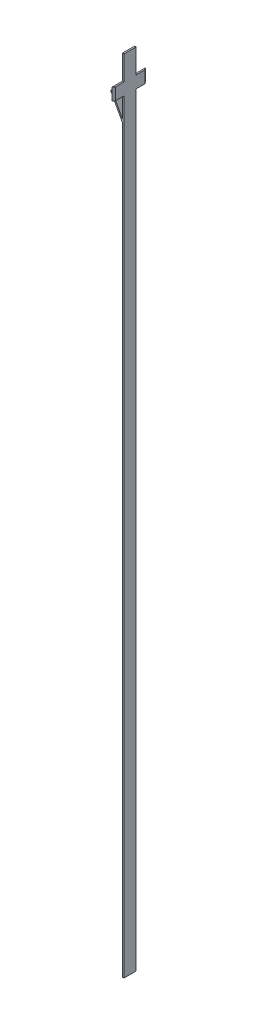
ISO-10303-21;
HEADER;
FILE_DESCRIPTION(('STEP AP214'),'2;1');
FILE_NAME('part.step','',(''),(''),'','','');
FILE_SCHEMA(('AUTOMOTIVE_DESIGN { 1 0 10303 214 1 1 1 1 }'));
ENDSEC;
DATA;
#1=APPLICATION_CONTEXT('core data for automotive mechanical design processes');
#2=APPLICATION_PROTOCOL_DEFINITION('international standard','automotive_design',2000,#1);
#3=PRODUCT_CONTEXT('',#1,'mechanical');
#4=PRODUCT('Part','Part','',(#3));
#5=PRODUCT_RELATED_PRODUCT_CATEGORY('part','',(#4));
#6=PRODUCT_DEFINITION_FORMATION('','',#4);
#7=PRODUCT_DEFINITION_CONTEXT('part definition',#1,'design');
#8=PRODUCT_DEFINITION('design','',#6,#7);
#9=PRODUCT_DEFINITION_SHAPE('','',#8);
#10=(LENGTH_UNIT() NAMED_UNIT(*) SI_UNIT(.MILLI.,.METRE.));
#11=(NAMED_UNIT(*) PLANE_ANGLE_UNIT() SI_UNIT($,.RADIAN.));
#12=(NAMED_UNIT(*) SI_UNIT($,.STERADIAN.) SOLID_ANGLE_UNIT());
#13=UNCERTAINTY_MEASURE_WITH_UNIT(LENGTH_MEASURE(1.E-05),#10,'distance_accuracy_value','');
#14=(GEOMETRIC_REPRESENTATION_CONTEXT(3) GLOBAL_UNCERTAINTY_ASSIGNED_CONTEXT((#13)) GLOBAL_UNIT_ASSIGNED_CONTEXT((#10,
#11,#12)) REPRESENTATION_CONTEXT('',''));
#15=CARTESIAN_POINT('',(0.,0.,0.));
#16=DIRECTION('',(0.,0.,1.));
#17=DIRECTION('',(1.,0.,0.));
#18=AXIS2_PLACEMENT_3D('',#15,#16,#17);
#19=CARTESIAN_POINT('',(0.,-10.,18.));
#20=DIRECTION('',(0.,-1.,0.));
#21=DIRECTION('',(0.,0.,-1.));
#22=AXIS2_PLACEMENT_3D('',#19,#20,#21);
#23=PLANE('',#22);
#24=CARTESIAN_POINT('',(-8.56,-10.,0.));
#25=DIRECTION('',(0.,-1.,0.));
#26=DIRECTION('',(0.,0.,-1.));
#27=AXIS2_PLACEMENT_3D('',#24,#25,#26);
#28=CIRCLE('',#27,11.);
#29=CARTESIAN_POINT('',(0.610000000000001,-10.,6.07545060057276));
#30=VERTEX_POINT('',#29);
#31=CARTESIAN_POINT('',(0.,-10.,6.90842963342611));
#32=VERTEX_POINT('',#31);
#33=EDGE_CURVE('E86',#30,#32,#28,.T.);
#34=ORIENTED_EDGE('',*,*,#33,.F.);
#35=DIRECTION('',(0.,0.,-1.));
#36=VECTOR('',#35,1.);
#37=CARTESIAN_POINT('',(0.610000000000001,-10.,18.));
#38=LINE('',#37,#36);
#39=CARTESIAN_POINT('',(0.610000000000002,-10.,2.5));
#40=VERTEX_POINT('',#39);
#41=EDGE_CURVE('E199',#30,#40,#38,.T.);
#42=ORIENTED_EDGE('',*,*,#41,.T.);
#43=DIRECTION('',(1.,0.,0.));
#44=VECTOR('',#43,1.);
#45=CARTESIAN_POINT('',(0.,-10.,2.5));
#46=LINE('',#45,#44);
#47=CARTESIAN_POINT('',(0.,-10.,2.5));
#48=VERTEX_POINT('',#47);
#49=EDGE_CURVE('E236',#48,#40,#46,.T.);
#50=ORIENTED_EDGE('',*,*,#49,.F.);
#51=DIRECTION('',(0.,0.,-1.));
#52=VECTOR('',#51,1.);
#53=CARTESIAN_POINT('',(0.,-10.,18.));
#54=LINE('',#53,#52);
#55=EDGE_CURVE('E200',#32,#48,#54,.T.);
#56=ORIENTED_EDGE('',*,*,#55,.F.);
#57=EDGE_LOOP('',(#34,#42,#50,#56));
#58=FACE_BOUND('',#57,.T.);
#59=ADVANCED_FACE('F71',(#58),#23,.F.);
#60=CARTESIAN_POINT('',(0.,-15.,18.));
#61=DIRECTION('',(0.,1.,0.));
#62=DIRECTION('',(0.,0.,1.));
#63=AXIS2_PLACEMENT_3D('',#60,#61,#62);
#64=PLANE('',#63);
#65=CARTESIAN_POINT('',(-8.56,-15.,0.));
#66=DIRECTION('',(0.,1.,0.));
#67=DIRECTION('',(0.,0.,1.));
#68=AXIS2_PLACEMENT_3D('',#65,#66,#67);
#69=CIRCLE('',#68,11.);
#70=CARTESIAN_POINT('',(0.,-15.,6.90842963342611));
#71=VERTEX_POINT('',#70);
#72=CARTESIAN_POINT('',(0.610000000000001,-15.,6.07545060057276));
#73=VERTEX_POINT('',#72);
#74=EDGE_CURVE('E219',#71,#73,#69,.T.);
#75=ORIENTED_EDGE('',*,*,#74,.F.);
#76=DIRECTION('',(0.,0.,-1.));
#77=VECTOR('',#76,1.);
#78=CARTESIAN_POINT('',(0.,-15.,18.));
#79=LINE('',#78,#77);
#80=CARTESIAN_POINT('',(0.,-15.,2.5));
#81=VERTEX_POINT('',#80);
#82=EDGE_CURVE('E234',#71,#81,#79,.T.);
#83=ORIENTED_EDGE('',*,*,#82,.T.);
#84=DIRECTION('',(-1.,0.,0.));
#85=VECTOR('',#84,1.);
#86=CARTESIAN_POINT('',(0.,-15.,2.5));
#87=LINE('',#86,#85);
#88=CARTESIAN_POINT('',(0.610000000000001,-15.,2.5));
#89=VERTEX_POINT('',#88);
#90=EDGE_CURVE('E240',#89,#81,#87,.T.);
#91=ORIENTED_EDGE('',*,*,#90,.F.);
#92=DIRECTION('',(0.,0.,-1.));
#93=VECTOR('',#92,1.);
#94=CARTESIAN_POINT('',(0.610000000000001,-15.,18.));
#95=LINE('',#94,#93);
#96=EDGE_CURVE('E231',#73,#89,#95,.T.);
#97=ORIENTED_EDGE('',*,*,#96,.F.);
#98=EDGE_LOOP('',(#75,#83,#91,#97));
#99=FACE_BOUND('',#98,.T.);
#100=ADVANCED_FACE('F333',(#99),#64,.F.);
#101=CARTESIAN_POINT('',(-8.56,-15.,0.));
#102=DIRECTION('',(0.,1.,0.));
#103=DIRECTION('',(0.,0.,1.));
#104=AXIS2_PLACEMENT_3D('',#101,#102,#103);
#105=CIRCLE('',#104,11.);
#106=CARTESIAN_POINT('',(0.610000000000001,-15.,-6.07545060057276));
#107=VERTEX_POINT('',#106);
#108=CARTESIAN_POINT('',(0.,-15.,-6.90842963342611));
#109=VERTEX_POINT('',#108);
#110=EDGE_CURVE('E215',#107,#109,#105,.T.);
#111=ORIENTED_EDGE('',*,*,#110,.F.);
#112=CARTESIAN_POINT('',(0.610000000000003,-15.,-2.5));
#113=VERTEX_POINT('',#112);
#114=EDGE_CURVE('E208',#113,#107,#95,.T.);
#115=ORIENTED_EDGE('',*,*,#114,.F.);
#116=DIRECTION('',(-1.,0.,0.));
#117=VECTOR('',#116,1.);
#118=CARTESIAN_POINT('',(0.,-15.,-2.5));
#119=LINE('',#118,#117);
#120=CARTESIAN_POINT('',(0.,-15.,-2.5));
#121=VERTEX_POINT('',#120);
#122=EDGE_CURVE('E243',#113,#121,#119,.T.);
#123=ORIENTED_EDGE('',*,*,#122,.T.);
#124=EDGE_CURVE('E233',#121,#109,#79,.T.);
#125=ORIENTED_EDGE('',*,*,#124,.T.);
#126=EDGE_LOOP('',(#111,#115,#123,#125));
#127=FACE_BOUND('',#126,.T.);
#128=ADVANCED_FACE('F356',(#127),#64,.F.);
#129=CARTESIAN_POINT('',(-8.56,-10.,0.));
#130=DIRECTION('',(0.,-1.,0.));
#131=DIRECTION('',(0.,0.,-1.));
#132=AXIS2_PLACEMENT_3D('',#129,#130,#131);
#133=CIRCLE('',#132,11.);
#134=CARTESIAN_POINT('',(0.,-10.,-6.90842963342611));
#135=VERTEX_POINT('',#134);
#136=CARTESIAN_POINT('',(0.610000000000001,-10.,-6.07545060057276));
#137=VERTEX_POINT('',#136);
#138=EDGE_CURVE('E12',#135,#137,#133,.T.);
#139=ORIENTED_EDGE('',*,*,#138,.F.);
#140=CARTESIAN_POINT('',(0.,-10.,-2.5));
#141=VERTEX_POINT('',#140);
#142=EDGE_CURVE('E229',#141,#135,#54,.T.);
#143=ORIENTED_EDGE('',*,*,#142,.F.);
#144=DIRECTION('',(1.,0.,0.));
#145=VECTOR('',#144,1.);
#146=CARTESIAN_POINT('',(0.,-10.,-2.5));
#147=LINE('',#146,#145);
#148=CARTESIAN_POINT('',(0.610000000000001,-10.,-2.5));
#149=VERTEX_POINT('',#148);
#150=EDGE_CURVE('E196',#141,#149,#147,.T.);
#151=ORIENTED_EDGE('',*,*,#150,.T.);
#152=EDGE_CURVE('E191',#149,#137,#38,.T.);
#153=ORIENTED_EDGE('',*,*,#152,.T.);
#154=EDGE_LOOP('',(#139,#143,#151,#153));
#155=FACE_BOUND('',#154,.T.);
#156=ADVANCED_FACE('F193',(#155),#23,.F.);
#157=CARTESIAN_POINT('',(0.,0.,-2.5));
#158=DIRECTION('',(0.,0.,1.));
#159=DIRECTION('',(1.,0.,0.));
#160=AXIS2_PLACEMENT_3D('',#157,#158,#159);
#161=PLANE('',#160);
#162=DIRECTION('',(0.,-1.,0.));
#163=VECTOR('',#162,1.);
#164=CARTESIAN_POINT('',(0.,0.,-2.5));
#165=LINE('',#164,#163);
#166=CARTESIAN_POINT('',(0.,-15.6194102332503,-2.5));
#167=VERTEX_POINT('',#166);
#168=CARTESIAN_POINT('',(0.,-23.7147562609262,-2.5));
#169=VERTEX_POINT('',#168);
#170=EDGE_CURVE('E310',#167,#169,#165,.T.);
#171=ORIENTED_EDGE('',*,*,#170,.F.);
#172=DIRECTION('',(-0.984807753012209,-0.173648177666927,0.));
#173=VECTOR('',#172,1.);
#174=CARTESIAN_POINT('',(2.67107646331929,-15.1484273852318,-2.5));
#175=LINE('',#174,#173);
#176=CARTESIAN_POINT('',(-3.98617976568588,-16.3222812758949,-2.5));
#177=VERTEX_POINT('',#176);
#178=EDGE_CURVE('E263',#167,#177,#175,.T.);
#179=ORIENTED_EDGE('',*,*,#178,.T.);
#180=DIRECTION('',(0.474618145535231,-0.880191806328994,0.));
#181=VECTOR('',#180,1.);
#182=CARTESIAN_POINT('',(-9.90695806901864,-5.34204253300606,-2.5));
#183=LINE('',#182,#181);
#184=EDGE_CURVE('E260',#177,#169,#183,.T.);
#185=ORIENTED_EDGE('',*,*,#184,.T.);
#186=EDGE_LOOP('',(#171,#179,#185));
#187=FACE_BOUND('',#186,.T.);
#188=ORIENTED_EDGE('',*,*,#122,.F.);
#189=DIRECTION('',(0.,-1.,0.));
#190=VECTOR('',#189,1.);
#191=CARTESIAN_POINT('',(0.610000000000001,0.,-2.5));
#192=LINE('',#191,#190);
#193=CARTESIAN_POINT('',(0.610000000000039,-330.,-2.5));
#194=VERTEX_POINT('',#193);
#195=EDGE_CURVE('E301',#113,#194,#192,.T.);
#196=ORIENTED_EDGE('',*,*,#195,.T.);
#197=DIRECTION('',(1.,0.,0.));
#198=VECTOR('',#197,1.);
#199=CARTESIAN_POINT('',(0.,-330.,-2.5));
#200=LINE('',#199,#198);
#201=CARTESIAN_POINT('',(0.,-330.,-2.5));
#202=VERTEX_POINT('',#201);
#203=EDGE_CURVE('E304',#202,#194,#200,.T.);
#204=ORIENTED_EDGE('',*,*,#203,.F.);
#205=CARTESIAN_POINT('',(0.,-25.,-2.5));
#206=VERTEX_POINT('',#205);
#207=EDGE_CURVE('E307',#206,#202,#165,.T.);
#208=ORIENTED_EDGE('',*,*,#207,.F.);
#209=DIRECTION('',(0.474618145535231,-0.880191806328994,0.));
#210=VECTOR('',#209,1.);
#211=CARTESIAN_POINT('',(-10.4438750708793,-5.63155960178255,-2.5));
#212=LINE('',#211,#210);
#213=CARTESIAN_POINT('',(-4.92403876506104,-15.8682408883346,-2.5));
#214=VERTEX_POINT('',#213);
#215=EDGE_CURVE('E251',#214,#206,#212,.T.);
#216=ORIENTED_EDGE('',*,*,#215,.F.);
#217=DIRECTION('',(-0.984807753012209,-0.173648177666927,0.));
#218=VECTOR('',#217,1.);
#219=CARTESIAN_POINT('',(2.56515107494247,-14.5476946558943,-2.5));
#220=LINE('',#219,#218);
#221=EDGE_CURVE('E267',#121,#214,#220,.T.);
#222=ORIENTED_EDGE('',*,*,#221,.F.);
#223=EDGE_LOOP('',(#188,#196,#204,#208,#216,#222));
#224=FACE_BOUND('',#223,.T.);
#225=ADVANCED_FACE('F353',(#187,#224),#161,.F.);
#226=ORIENTED_EDGE('',*,*,#150,.F.);
#227=CARTESIAN_POINT('',(0.,0.,-2.5));
#228=VERTEX_POINT('',#227);
#229=EDGE_CURVE('E286',#228,#141,#165,.T.);
#230=ORIENTED_EDGE('',*,*,#229,.F.);
#231=DIRECTION('',(1.,0.,0.));
#232=VECTOR('',#231,1.);
#233=CARTESIAN_POINT('',(0.,0.,-2.5));
#234=LINE('',#233,#232);
#235=CARTESIAN_POINT('',(0.610000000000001,0.,-2.5));
#236=VERTEX_POINT('',#235);
#237=EDGE_CURVE('E246',#228,#236,#234,.T.);
#238=ORIENTED_EDGE('',*,*,#237,.T.);
#239=EDGE_CURVE('E302',#236,#149,#192,.T.);
#240=ORIENTED_EDGE('',*,*,#239,.T.);
#241=EDGE_LOOP('',(#226,#230,#238,#240));
#242=FACE_BOUND('',#241,.T.);
#243=ADVANCED_FACE('F323',(#242),#161,.F.);
#244=CARTESIAN_POINT('',(0.,0.,2.5));
#245=DIRECTION('',(0.,0.,1.));
#246=DIRECTION('',(1.,0.,0.));
#247=AXIS2_PLACEMENT_3D('',#244,#245,#246);
#248=PLANE('',#247);
#249=DIRECTION('',(-0.984807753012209,-0.173648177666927,0.));
#250=VECTOR('',#249,1.);
#251=CARTESIAN_POINT('',(2.67107646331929,-15.1484273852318,2.5));
#252=LINE('',#251,#250);
#253=CARTESIAN_POINT('',(0.,-15.6194102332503,2.5));
#254=VERTEX_POINT('',#253);
#255=CARTESIAN_POINT('',(-3.98617976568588,-16.3222812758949,2.5));
#256=VERTEX_POINT('',#255);
#257=EDGE_CURVE('E250',#254,#256,#252,.T.);
#258=ORIENTED_EDGE('',*,*,#257,.F.);
#259=DIRECTION('',(0.,-1.,0.));
#260=VECTOR('',#259,1.);
#261=CARTESIAN_POINT('',(0.,0.,2.5));
#262=LINE('',#261,#260);
#263=CARTESIAN_POINT('',(0.,-23.7147562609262,2.5));
#264=VERTEX_POINT('',#263);
#265=EDGE_CURVE('E298',#254,#264,#262,.T.);
#266=ORIENTED_EDGE('',*,*,#265,.T.);
#267=DIRECTION('',(0.474618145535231,-0.880191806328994,0.));
#268=VECTOR('',#267,1.);
#269=CARTESIAN_POINT('',(-9.90695806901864,-5.34204253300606,2.5));
#270=LINE('',#269,#268);
#271=EDGE_CURVE('E247',#256,#264,#270,.T.);
#272=ORIENTED_EDGE('',*,*,#271,.F.);
#273=EDGE_LOOP('',(#258,#266,#272));
#274=FACE_BOUND('',#273,.T.);
#275=DIRECTION('',(0.,-1.,0.));
#276=VECTOR('',#275,1.);
#277=CARTESIAN_POINT('',(0.610000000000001,0.,2.5));
#278=LINE('',#277,#276);
#279=CARTESIAN_POINT('',(0.610000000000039,-330.,2.5));
#280=VERTEX_POINT('',#279);
#281=EDGE_CURVE('E285',#89,#280,#278,.T.);
#282=ORIENTED_EDGE('',*,*,#281,.F.);
#283=ORIENTED_EDGE('',*,*,#90,.T.);
#284=DIRECTION('',(-0.984807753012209,-0.173648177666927,0.));
#285=VECTOR('',#284,1.);
#286=CARTESIAN_POINT('',(2.56515107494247,-14.5476946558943,2.5));
#287=LINE('',#286,#285);
#288=CARTESIAN_POINT('',(-4.92403876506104,-15.8682408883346,2.5));
#289=VERTEX_POINT('',#288);
#290=EDGE_CURVE('E254',#81,#289,#287,.T.);
#291=ORIENTED_EDGE('',*,*,#290,.T.);
#292=DIRECTION('',(0.474618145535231,-0.880191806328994,0.));
#293=VECTOR('',#292,1.);
#294=CARTESIAN_POINT('',(-10.4438750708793,-5.63155960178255,2.5));
#295=LINE('',#294,#293);
#296=CARTESIAN_POINT('',(0.,-25.,2.5));
#297=VERTEX_POINT('',#296);
#298=EDGE_CURVE('E256',#289,#297,#295,.T.);
#299=ORIENTED_EDGE('',*,*,#298,.T.);
#300=CARTESIAN_POINT('',(0.,-330.,2.5));
#301=VERTEX_POINT('',#300);
#302=EDGE_CURVE('E293',#297,#301,#262,.T.);
#303=ORIENTED_EDGE('',*,*,#302,.T.);
#304=DIRECTION('',(1.,0.,0.));
#305=VECTOR('',#304,1.);
#306=CARTESIAN_POINT('',(0.,-330.,2.5));
#307=LINE('',#306,#305);
#308=EDGE_CURVE('E290',#301,#280,#307,.T.);
#309=ORIENTED_EDGE('',*,*,#308,.T.);
#310=EDGE_LOOP('',(#282,#283,#291,#299,#303,#309));
#311=FACE_BOUND('',#310,.T.);
#312=ADVANCED_FACE('F344',(#274,#311),#248,.T.);
#313=CARTESIAN_POINT('',(0.,0.,2.5));
#314=VERTEX_POINT('',#313);
#315=EDGE_CURVE('E294',#314,#48,#262,.T.);
#316=ORIENTED_EDGE('',*,*,#315,.T.);
#317=ORIENTED_EDGE('',*,*,#49,.T.);
#318=CARTESIAN_POINT('',(0.610000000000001,0.,2.5));
#319=VERTEX_POINT('',#318);
#320=EDGE_CURVE('E287',#319,#40,#278,.T.);
#321=ORIENTED_EDGE('',*,*,#320,.F.);
#322=DIRECTION('',(1.,0.,0.));
#323=VECTOR('',#322,1.);
#324=CARTESIAN_POINT('',(0.,0.,2.5));
#325=LINE('',#324,#323);
#326=EDGE_CURVE('E282',#314,#319,#325,.T.);
#327=ORIENTED_EDGE('',*,*,#326,.F.);
#328=EDGE_LOOP('',(#316,#317,#321,#327));
#329=FACE_BOUND('',#328,.T.);
#330=ADVANCED_FACE('F328',(#329),#248,.T.);
#331=CARTESIAN_POINT('',(2.67107646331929,-15.1484273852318,2.5));
#332=DIRECTION('',(0.173648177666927,-0.984807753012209,0.));
#333=DIRECTION('',(0.984807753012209,0.173648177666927,0.));
#334=AXIS2_PLACEMENT_3D('',#331,#332,#333);
#335=PLANE('',#334);
#336=ORIENTED_EDGE('',*,*,#178,.F.);
#337=DIRECTION('',(0.,0.,-1.));
#338=VECTOR('',#337,1.);
#339=CARTESIAN_POINT('',(0.,-15.6194102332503,2.5));
#340=LINE('',#339,#338);
#341=EDGE_CURVE('E279',#254,#167,#340,.T.);
#342=ORIENTED_EDGE('',*,*,#341,.F.);
#343=ORIENTED_EDGE('',*,*,#257,.T.);
#344=DIRECTION('',(0.,0.,-1.));
#345=VECTOR('',#344,1.);
#346=CARTESIAN_POINT('',(-3.98617976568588,-16.3222812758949,2.5));
#347=LINE('',#346,#345);
#348=EDGE_CURVE('E79',#256,#177,#347,.T.);
#349=ORIENTED_EDGE('',*,*,#348,.T.);
#350=EDGE_LOOP('',(#336,#342,#343,#349));
#351=FACE_BOUND('',#350,.T.);
#352=ADVANCED_FACE('F394',(#351),#335,.T.);
#353=CARTESIAN_POINT('',(2.56515107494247,-14.5476946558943,2.5));
#354=DIRECTION('',(0.173648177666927,-0.984807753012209,0.));
#355=DIRECTION('',(0.984807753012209,0.173648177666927,0.));
#356=AXIS2_PLACEMENT_3D('',#353,#354,#355);
#357=PLANE('',#356);
#358=ORIENTED_EDGE('',*,*,#221,.T.);
#359=DIRECTION('',(0.,0.,-1.));
#360=VECTOR('',#359,1.);
#361=CARTESIAN_POINT('',(-4.92403876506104,-15.8682408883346,2.5));
#362=LINE('',#361,#360);
#363=EDGE_CURVE('E274',#289,#214,#362,.T.);
#364=ORIENTED_EDGE('',*,*,#363,.F.);
#365=ORIENTED_EDGE('',*,*,#290,.F.);
#366=DIRECTION('',(0.,0.,-1.));
#367=VECTOR('',#366,1.);
#368=CARTESIAN_POINT('',(0.,-15.,2.5));
#369=LINE('',#368,#367);
#370=EDGE_CURVE('E277',#81,#121,#369,.T.);
#371=ORIENTED_EDGE('',*,*,#370,.T.);
#372=EDGE_LOOP('',(#358,#364,#365,#371));
#373=FACE_BOUND('',#372,.T.);
#374=ADVANCED_FACE('F340',(#373),#357,.F.);
#375=CARTESIAN_POINT('',(-10.4438750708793,-5.63155960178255,2.5));
#376=DIRECTION('',(0.880191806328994,0.474618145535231,0.));
#377=DIRECTION('',(-0.474618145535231,0.880191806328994,0.));
#378=AXIS2_PLACEMENT_3D('',#375,#376,#377);
#379=PLANE('',#378);
#380=ORIENTED_EDGE('',*,*,#215,.T.);
#381=DIRECTION('',(0.,0.,-1.));
#382=VECTOR('',#381,1.);
#383=CARTESIAN_POINT('',(0.,-25.,2.5));
#384=LINE('',#383,#382);
#385=EDGE_CURVE('E272',#297,#206,#384,.T.);
#386=ORIENTED_EDGE('',*,*,#385,.F.);
#387=ORIENTED_EDGE('',*,*,#298,.F.);
#388=ORIENTED_EDGE('',*,*,#363,.T.);
#389=EDGE_LOOP('',(#380,#386,#387,#388));
#390=FACE_BOUND('',#389,.T.);
#391=ADVANCED_FACE('F392',(#390),#379,.F.);
#392=CARTESIAN_POINT('',(-9.90695806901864,-5.34204253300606,2.5));
#393=DIRECTION('',(0.880191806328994,0.474618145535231,0.));
#394=DIRECTION('',(-0.474618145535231,0.880191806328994,0.));
#395=AXIS2_PLACEMENT_3D('',#392,#393,#394);
#396=PLANE('',#395);
#397=ORIENTED_EDGE('',*,*,#184,.F.);
#398=ORIENTED_EDGE('',*,*,#348,.F.);
#399=ORIENTED_EDGE('',*,*,#271,.T.);
#400=DIRECTION('',(0.,0.,-1.));
#401=VECTOR('',#400,1.);
#402=CARTESIAN_POINT('',(0.,-23.7147562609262,2.5));
#403=LINE('',#402,#401);
#404=EDGE_CURVE('E259',#264,#169,#403,.T.);
#405=ORIENTED_EDGE('',*,*,#404,.T.);
#406=EDGE_LOOP('',(#397,#398,#399,#405));
#407=FACE_BOUND('',#406,.T.);
#408=ADVANCED_FACE('F389',(#407),#396,.T.);
#409=CARTESIAN_POINT('',(0.,0.,2.5));
#410=DIRECTION('',(1.,0.,0.));
#411=DIRECTION('',(0.,1.,0.));
#412=AXIS2_PLACEMENT_3D('',#409,#410,#411);
#413=PLANE('',#412);
#414=DIRECTION('',(0.,1.,0.));
#415=VECTOR('',#414,1.);
#416=CARTESIAN_POINT('',(0.,-330.,-6.90842963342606));
#417=LINE('',#416,#415);
#418=EDGE_CURVE('E211',#109,#135,#417,.T.);
#419=ORIENTED_EDGE('',*,*,#418,.F.);
#420=ORIENTED_EDGE('',*,*,#124,.F.);
#421=ORIENTED_EDGE('',*,*,#370,.F.);
#422=ORIENTED_EDGE('',*,*,#82,.F.);
#423=DIRECTION('',(0.,1.,0.));
#424=VECTOR('',#423,1.);
#425=CARTESIAN_POINT('',(0.,-330.,6.90842963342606));
#426=LINE('',#425,#424);
#427=EDGE_CURVE('E94',#32,#71,#426,.F.);
#428=ORIENTED_EDGE('',*,*,#427,.F.);
#429=ORIENTED_EDGE('',*,*,#55,.T.);
#430=ORIENTED_EDGE('',*,*,#315,.F.);
#431=DIRECTION('',(0.,0.,-1.));
#432=VECTOR('',#431,1.);
#433=CARTESIAN_POINT('',(0.,0.,2.5));
#434=LINE('',#433,#432);
#435=EDGE_CURVE('E264',#314,#228,#434,.T.);
#436=ORIENTED_EDGE('',*,*,#435,.T.);
#437=ORIENTED_EDGE('',*,*,#229,.T.);
#438=ORIENTED_EDGE('',*,*,#142,.T.);
#439=EDGE_LOOP('',(#419,#420,#421,#422,#428,#429,#430,#436,#437,#438));
#440=FACE_BOUND('',#439,.T.);
#441=ADVANCED_FACE('F324',(#440),#413,.F.);
#442=ORIENTED_EDGE('',*,*,#404,.F.);
#443=ORIENTED_EDGE('',*,*,#265,.F.);
#444=ORIENTED_EDGE('',*,*,#341,.T.);
#445=ORIENTED_EDGE('',*,*,#170,.T.);
#446=EDGE_LOOP('',(#442,#443,#444,#445));
#447=FACE_BOUND('',#446,.T.);
#448=ADVANCED_FACE('F378',(#447),#413,.F.);
#449=ORIENTED_EDGE('',*,*,#302,.F.);
#450=ORIENTED_EDGE('',*,*,#385,.T.);
#451=ORIENTED_EDGE('',*,*,#207,.T.);
#452=DIRECTION('',(0.,0.,-1.));
#453=VECTOR('',#452,1.);
#454=CARTESIAN_POINT('',(0.,-330.,2.5));
#455=LINE('',#454,#453);
#456=EDGE_CURVE('E312',#301,#202,#455,.T.);
#457=ORIENTED_EDGE('',*,*,#456,.F.);
#458=EDGE_LOOP('',(#449,#450,#451,#457));
#459=FACE_BOUND('',#458,.T.);
#460=ADVANCED_FACE('F379',(#459),#413,.F.);
#461=CARTESIAN_POINT('',(0.,-330.,2.5));
#462=DIRECTION('',(0.,1.,0.));
#463=DIRECTION('',(0.,0.,1.));
#464=AXIS2_PLACEMENT_3D('',#461,#462,#463);
#465=PLANE('',#464);
#466=ORIENTED_EDGE('',*,*,#203,.T.);
#467=DIRECTION('',(0.,0.,-1.));
#468=VECTOR('',#467,1.);
#469=CARTESIAN_POINT('',(0.610000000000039,-330.,2.5));
#470=LINE('',#469,#468);
#471=EDGE_CURVE('E315',#280,#194,#470,.T.);
#472=ORIENTED_EDGE('',*,*,#471,.F.);
#473=ORIENTED_EDGE('',*,*,#308,.F.);
#474=ORIENTED_EDGE('',*,*,#456,.T.);
#475=EDGE_LOOP('',(#466,#472,#473,#474));
#476=FACE_BOUND('',#475,.T.);
#477=ADVANCED_FACE('F349',(#476),#465,.F.);
#478=CARTESIAN_POINT('',(0.610000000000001,0.,2.5));
#479=DIRECTION('',(1.,0.,0.));
#480=DIRECTION('',(0.,1.,0.));
#481=AXIS2_PLACEMENT_3D('',#478,#479,#480);
#482=PLANE('',#481);
#483=ORIENTED_EDGE('',*,*,#114,.T.);
#484=DIRECTION('',(0.,1.,0.));
#485=VECTOR('',#484,1.);
#486=CARTESIAN_POINT('',(0.610000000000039,-330.,-6.07545060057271));
#487=LINE('',#486,#485);
#488=EDGE_CURVE('E204',#107,#137,#487,.T.);
#489=ORIENTED_EDGE('',*,*,#488,.T.);
#490=ORIENTED_EDGE('',*,*,#152,.F.);
#491=ORIENTED_EDGE('',*,*,#239,.F.);
#492=DIRECTION('',(0.,0.,-1.));
#493=VECTOR('',#492,1.);
#494=CARTESIAN_POINT('',(0.610000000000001,0.,2.5));
#495=LINE('',#494,#493);
#496=EDGE_CURVE('E297',#319,#236,#495,.T.);
#497=ORIENTED_EDGE('',*,*,#496,.F.);
#498=ORIENTED_EDGE('',*,*,#320,.T.);
#499=ORIENTED_EDGE('',*,*,#41,.F.);
#500=DIRECTION('',(0.,1.,0.));
#501=VECTOR('',#500,1.);
#502=CARTESIAN_POINT('',(0.610000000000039,-330.,6.07545060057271));
#503=LINE('',#502,#501);
#504=EDGE_CURVE('E224',#30,#73,#503,.F.);
#505=ORIENTED_EDGE('',*,*,#504,.T.);
#506=ORIENTED_EDGE('',*,*,#96,.T.);
#507=ORIENTED_EDGE('',*,*,#281,.T.);
#508=ORIENTED_EDGE('',*,*,#471,.T.);
#509=ORIENTED_EDGE('',*,*,#195,.F.);
#510=EDGE_LOOP('',(#483,#489,#490,#491,#497,#498,#499,#505,#506,#507,#508,#509));
#511=FACE_BOUND('',#510,.T.);
#512=ADVANCED_FACE('F205',(#511),#482,.T.);
#513=CARTESIAN_POINT('',(0.,0.,2.5));
#514=DIRECTION('',(0.,1.,0.));
#515=DIRECTION('',(0.,0.,1.));
#516=AXIS2_PLACEMENT_3D('',#513,#514,#515);
#517=PLANE('',#516);
#518=ORIENTED_EDGE('',*,*,#237,.F.);
#519=ORIENTED_EDGE('',*,*,#435,.F.);
#520=ORIENTED_EDGE('',*,*,#326,.T.);
#521=ORIENTED_EDGE('',*,*,#496,.T.);
#522=EDGE_LOOP('',(#518,#519,#520,#521));
#523=FACE_BOUND('',#522,.T.);
#524=ADVANCED_FACE('F73',(#523),#517,.T.);
#525=CARTESIAN_POINT('',(-8.56,-330.,0.));
#526=DIRECTION('',(0.,1.,0.));
#527=DIRECTION('',(0.,0.,1.));
#528=AXIS2_PLACEMENT_3D('',#525,#526,#527);
#529=CYLINDRICAL_SURFACE('',#528,11.);
#530=ORIENTED_EDGE('',*,*,#488,.F.);
#531=ORIENTED_EDGE('',*,*,#110,.T.);
#532=ORIENTED_EDGE('',*,*,#418,.T.);
#533=ORIENTED_EDGE('',*,*,#138,.T.);
#534=EDGE_LOOP('',(#530,#531,#532,#533));
#535=FACE_BOUND('',#534,.T.);
#536=ADVANCED_FACE('F214',(#535),#529,.T.);
#537=ORIENTED_EDGE('',*,*,#504,.F.);
#538=ORIENTED_EDGE('',*,*,#33,.T.);
#539=ORIENTED_EDGE('',*,*,#427,.T.);
#540=ORIENTED_EDGE('',*,*,#74,.T.);
#541=EDGE_LOOP('',(#537,#538,#539,#540));
#542=FACE_BOUND('',#541,.T.);
#543=ADVANCED_FACE('F331',(#542),#529,.T.);
#544=CLOSED_SHELL('',(#59,#100,#128,#156,#225,#243,#312,#330,#352,#374,#391,#408,#441,#448,#460,
#477,#512,#524,#536,#543));
#545=MANIFOLD_SOLID_BREP('B2',#544);
#546=ADVANCED_BREP_SHAPE_REPRESENTATION('',(#18,#545),#14);
#547=SHAPE_DEFINITION_REPRESENTATION(#9,#546);
ENDSEC;
END-ISO-10303-21;
